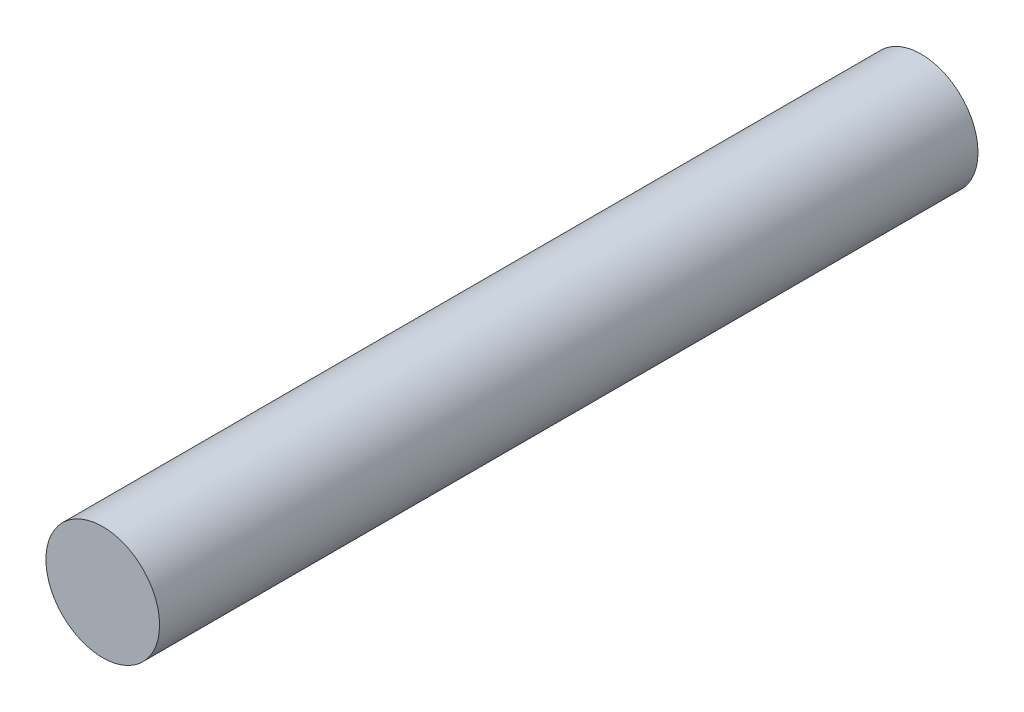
from build123d import *

# Parameters (mm, degrees)
SKETCH1_R      = 1.5875
EXTRUDE1_DEPTH = 11.43


with BuildPart() as part:
    # Sketch1 → Extrude1 (new, symmetric)
    with BuildSketch(Plane.XY):
        Circle(SKETCH1_R)
    extrude(amount=EXTRUDE1_DEPTH, both=True)


solid = part.part
